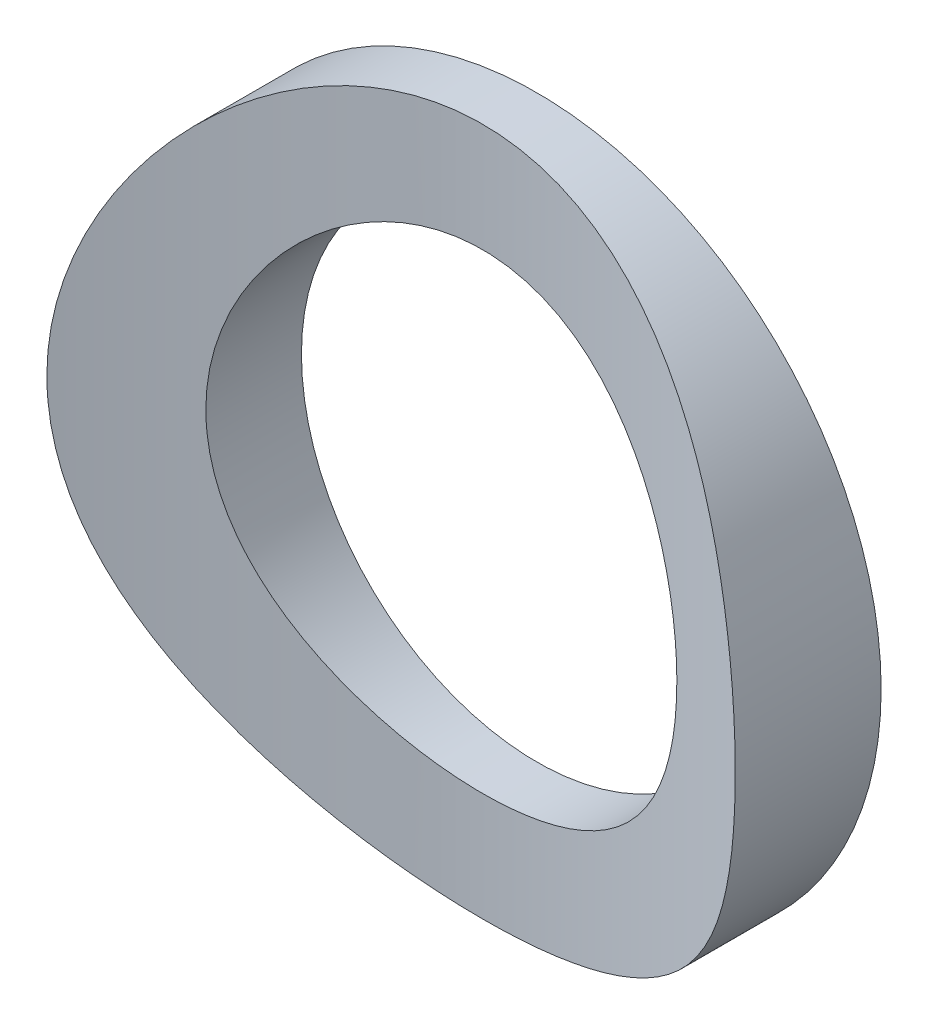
from build123d import *

# Parameters (mm, degrees)
ESQUISSE2_R             = 19
ESQUISSE2_R_2           = 13
BASE_EXTRUSION_DEPTH    = 10
ESQUISSE3_R             = 38.25
ENL_V_MAT_EXTRU_1_DEPTH = 50


with BuildPart() as part:
    # Esquisse2 → Base-Extrusion (new body)
    with BuildSketch(Plane.XY):
        with Locations(Location((0, 0, 0), (0, 0, 180))):
            Circle(ESQUISSE2_R)
        with Locations(Location((0, 0, 0), (0, 0, 180))):
            Circle(ESQUISSE2_R_2, mode=Mode.SUBTRACT)
    extrude(amount=BASE_EXTRUSION_DEPTH)

    # Esquisse3 → Enl_v. mat.-Extru.1 (cut, symmetric)
    with BuildSketch(Plane(origin=(0, 0, 0), x_dir=(1, 0, 0), z_dir=(0, 1, 0))):
        with Locations((0, -41.25)):
            Circle(ESQUISSE3_R)
    extrude(amount=ENL_V_MAT_EXTRU_1_DEPTH, both=True, mode=Mode.SUBTRACT)


solid = part.part
